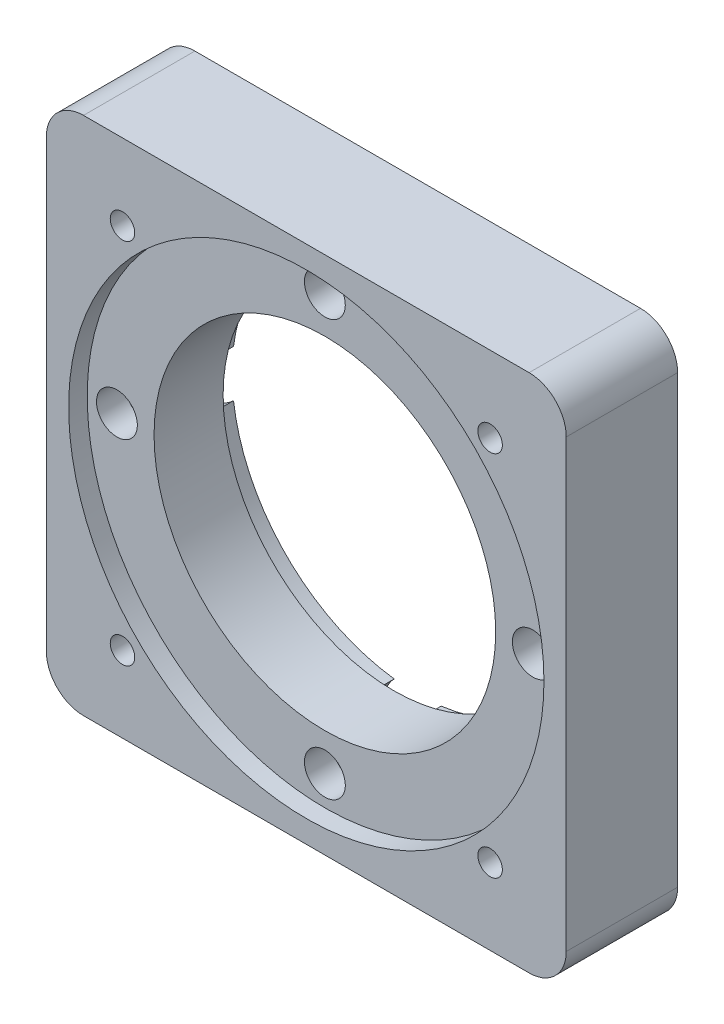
ISO-10303-21;
HEADER;
FILE_DESCRIPTION(('STEP AP214'),'2;1');
FILE_NAME('part.step','',(''),(''),'','','');
FILE_SCHEMA(('AUTOMOTIVE_DESIGN { 1 0 10303 214 1 1 1 1 }'));
ENDSEC;
DATA;
#1=APPLICATION_CONTEXT('core data for automotive mechanical design processes');
#2=APPLICATION_PROTOCOL_DEFINITION('international standard','automotive_design',2000,#1);
#3=PRODUCT_CONTEXT('',#1,'mechanical');
#4=PRODUCT('Part','Part','',(#3));
#5=PRODUCT_RELATED_PRODUCT_CATEGORY('part','',(#4));
#6=PRODUCT_DEFINITION_FORMATION('','',#4);
#7=PRODUCT_DEFINITION_CONTEXT('part definition',#1,'design');
#8=PRODUCT_DEFINITION('design','',#6,#7);
#9=PRODUCT_DEFINITION_SHAPE('','',#8);
#10=(LENGTH_UNIT() NAMED_UNIT(*) SI_UNIT(.MILLI.,.METRE.));
#11=(NAMED_UNIT(*) PLANE_ANGLE_UNIT() SI_UNIT($,.RADIAN.));
#12=(NAMED_UNIT(*) SI_UNIT($,.STERADIAN.) SOLID_ANGLE_UNIT());
#13=UNCERTAINTY_MEASURE_WITH_UNIT(LENGTH_MEASURE(1.E-05),#10,'distance_accuracy_value','');
#14=(GEOMETRIC_REPRESENTATION_CONTEXT(3) GLOBAL_UNCERTAINTY_ASSIGNED_CONTEXT((#13)) GLOBAL_UNIT_ASSIGNED_CONTEXT((#10,
#11,#12)) REPRESENTATION_CONTEXT('',''));
#15=CARTESIAN_POINT('',(0.,0.,0.));
#16=DIRECTION('',(0.,0.,1.));
#17=DIRECTION('',(1.,0.,0.));
#18=AXIS2_PLACEMENT_3D('',#15,#16,#17);
#19=CARTESIAN_POINT('',(0.,0.,-1.));
#20=DIRECTION('',(0.,0.,1.));
#21=DIRECTION('',(1.,0.,0.));
#22=AXIS2_PLACEMENT_3D('',#19,#20,#21);
#23=CYLINDRICAL_SURFACE('',#22,23.);
#24=CARTESIAN_POINT('',(0.,0.,12.5));
#25=DIRECTION('',(0.,0.,1.));
#26=DIRECTION('',(1.,0.,0.));
#27=AXIS2_PLACEMENT_3D('',#24,#25,#26);
#28=CIRCLE('',#27,23.);
#29=CARTESIAN_POINT('',(23.,0.,12.5));
#30=VERTEX_POINT('',#29);
#31=EDGE_CURVE('E298',#30,#30,#28,.T.);
#32=ORIENTED_EDGE('',*,*,#31,.T.);
#33=EDGE_LOOP('',(#32));
#34=FACE_BOUND('',#33,.T.);
#35=CARTESIAN_POINT('',(0.,0.,3.2));
#36=DIRECTION('',(0.,0.,-1.));
#37=DIRECTION('',(-1.,0.,0.));
#38=AXIS2_PLACEMENT_3D('',#35,#36,#37);
#39=CIRCLE('',#38,23.);
#40=CARTESIAN_POINT('',(-23.,0.,3.2));
#41=VERTEX_POINT('',#40);
#42=EDGE_CURVE('E200',#41,#41,#39,.F.);
#43=ORIENTED_EDGE('',*,*,#42,.F.);
#44=EDGE_LOOP('',(#43));
#45=FACE_BOUND('',#44,.T.);
#46=ADVANCED_FACE('F40',(#34,#45),#23,.F.);
#47=CARTESIAN_POINT('',(28.,2.93284432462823E-13,0.));
#48=DIRECTION('',(0.,0.,1.));
#49=DIRECTION('',(1.,0.,0.));
#50=AXIS2_PLACEMENT_3D('',#47,#48,#49);
#51=CYLINDRICAL_SURFACE('',#50,2.75);
#52=CARTESIAN_POINT('',(28.,2.93284432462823E-13,12.5));
#53=DIRECTION('',(0.,0.,1.));
#54=DIRECTION('',(0.,-1.,0.));
#55=AXIS2_PLACEMENT_3D('',#52,#53,#54);
#56=CIRCLE('',#55,2.75);
#57=CARTESIAN_POINT('',(28.,-2.74999999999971,12.5));
#58=VERTEX_POINT('',#57);
#59=EDGE_CURVE('E188',#58,#58,#56,.T.);
#60=ORIENTED_EDGE('',*,*,#59,.T.);
#61=EDGE_LOOP('',(#60));
#62=FACE_BOUND('',#61,.T.);
#63=CARTESIAN_POINT('',(28.,2.93284432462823E-13,8.65));
#64=DIRECTION('',(0.,0.,-1.));
#65=DIRECTION('',(-1.,0.,0.));
#66=AXIS2_PLACEMENT_3D('',#63,#64,#65);
#67=CIRCLE('',#66,2.75);
#68=CARTESIAN_POINT('',(25.25,2.93284432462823E-13,8.65));
#69=VERTEX_POINT('',#68);
#70=EDGE_CURVE('E195',#69,#69,#67,.F.);
#71=ORIENTED_EDGE('',*,*,#70,.F.);
#72=EDGE_LOOP('',(#71));
#73=FACE_BOUND('',#72,.T.);
#74=ADVANCED_FACE('F364',(#62,#73),#51,.F.);
#75=CARTESIAN_POINT('',(0.,-28.,0.));
#76=DIRECTION('',(0.,0.,1.));
#77=DIRECTION('',(1.,0.,0.));
#78=AXIS2_PLACEMENT_3D('',#75,#76,#77);
#79=CYLINDRICAL_SURFACE('',#78,2.75);
#80=CARTESIAN_POINT('',(0.,-28.,12.5));
#81=DIRECTION('',(0.,0.,1.));
#82=DIRECTION('',(-1.,0.,0.));
#83=AXIS2_PLACEMENT_3D('',#80,#81,#82);
#84=CIRCLE('',#83,2.75);
#85=CARTESIAN_POINT('',(-2.75,-28.,12.5));
#86=VERTEX_POINT('',#85);
#87=EDGE_CURVE('E313',#86,#86,#84,.T.);
#88=ORIENTED_EDGE('',*,*,#87,.T.);
#89=EDGE_LOOP('',(#88));
#90=FACE_BOUND('',#89,.T.);
#91=CARTESIAN_POINT('',(0.,-28.,8.65));
#92=DIRECTION('',(0.,0.,-1.));
#93=DIRECTION('',(-1.,0.,0.));
#94=AXIS2_PLACEMENT_3D('',#91,#92,#93);
#95=CIRCLE('',#94,2.75);
#96=CARTESIAN_POINT('',(-2.75,-28.,8.65));
#97=VERTEX_POINT('',#96);
#98=EDGE_CURVE('E190',#97,#97,#95,.F.);
#99=ORIENTED_EDGE('',*,*,#98,.F.);
#100=EDGE_LOOP('',(#99));
#101=FACE_BOUND('',#100,.T.);
#102=ADVANCED_FACE('F370',(#90,#101),#79,.F.);
#103=CARTESIAN_POINT('',(-28.,0.,0.));
#104=DIRECTION('',(0.,0.,1.));
#105=DIRECTION('',(1.,0.,0.));
#106=AXIS2_PLACEMENT_3D('',#103,#104,#105);
#107=CYLINDRICAL_SURFACE('',#106,2.75);
#108=CARTESIAN_POINT('',(-28.,0.,12.5));
#109=DIRECTION('',(0.,0.,1.));
#110=DIRECTION('',(0.,1.,0.));
#111=AXIS2_PLACEMENT_3D('',#108,#109,#110);
#112=CIRCLE('',#111,2.75);
#113=CARTESIAN_POINT('',(-28.,2.7499999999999,12.5));
#114=VERTEX_POINT('',#113);
#115=EDGE_CURVE('E316',#114,#114,#112,.T.);
#116=ORIENTED_EDGE('',*,*,#115,.T.);
#117=EDGE_LOOP('',(#116));
#118=FACE_BOUND('',#117,.T.);
#119=CARTESIAN_POINT('',(-28.,0.,8.65));
#120=DIRECTION('',(0.,0.,-1.));
#121=DIRECTION('',(-1.,0.,0.));
#122=AXIS2_PLACEMENT_3D('',#119,#120,#121);
#123=CIRCLE('',#122,2.75);
#124=CARTESIAN_POINT('',(-30.75,0.,8.65));
#125=VERTEX_POINT('',#124);
#126=EDGE_CURVE('E185',#125,#125,#123,.F.);
#127=ORIENTED_EDGE('',*,*,#126,.F.);
#128=EDGE_LOOP('',(#127));
#129=FACE_BOUND('',#128,.T.);
#130=ADVANCED_FACE('F404',(#118,#129),#107,.F.);
#131=CARTESIAN_POINT('',(0.,28.,0.));
#132=DIRECTION('',(0.,0.,1.));
#133=DIRECTION('',(1.,0.,0.));
#134=AXIS2_PLACEMENT_3D('',#131,#132,#133);
#135=CYLINDRICAL_SURFACE('',#134,2.75);
#136=CARTESIAN_POINT('',(0.,28.,12.5));
#137=DIRECTION('',(0.,0.,1.));
#138=DIRECTION('',(1.,0.,0.));
#139=AXIS2_PLACEMENT_3D('',#136,#137,#138);
#140=CIRCLE('',#139,2.75);
#141=CARTESIAN_POINT('',(2.75,28.,12.5));
#142=VERTEX_POINT('',#141);
#143=EDGE_CURVE('E183',#142,#142,#140,.T.);
#144=ORIENTED_EDGE('',*,*,#143,.T.);
#145=EDGE_LOOP('',(#144));
#146=FACE_BOUND('',#145,.T.);
#147=CARTESIAN_POINT('',(0.,28.,8.65));
#148=DIRECTION('',(0.,0.,-1.));
#149=DIRECTION('',(-1.,0.,0.));
#150=AXIS2_PLACEMENT_3D('',#147,#148,#149);
#151=CIRCLE('',#150,2.75);
#152=CARTESIAN_POINT('',(-2.75,28.,8.65));
#153=VERTEX_POINT('',#152);
#154=EDGE_CURVE('E180',#153,#153,#151,.F.);
#155=ORIENTED_EDGE('',*,*,#154,.F.);
#156=EDGE_LOOP('',(#155));
#157=FACE_BOUND('',#156,.T.);
#158=ADVANCED_FACE('F408',(#146,#157),#135,.F.);
#159=CARTESIAN_POINT('',(30.,-30.,15.));
#160=DIRECTION('',(0.,0.,-1.));
#161=DIRECTION('',(-1.,0.,0.));
#162=AXIS2_PLACEMENT_3D('',#159,#160,#161);
#163=CYLINDRICAL_SURFACE('',#162,5.);
#164=CARTESIAN_POINT('',(30.,-30.,0.));
#165=DIRECTION('',(0.,0.,1.));
#166=DIRECTION('',(-1.,0.,0.));
#167=AXIS2_PLACEMENT_3D('',#164,#165,#166);
#168=CIRCLE('',#167,5.);
#169=CARTESIAN_POINT('',(30.,-35.,0.));
#170=VERTEX_POINT('',#169);
#171=CARTESIAN_POINT('',(35.,-30.,0.));
#172=VERTEX_POINT('',#171);
#173=EDGE_CURVE('E149',#170,#172,#168,.T.);
#174=ORIENTED_EDGE('',*,*,#173,.T.);
#175=DIRECTION('',(0.,0.,-1.));
#176=VECTOR('',#175,1.);
#177=CARTESIAN_POINT('',(35.,-30.,15.));
#178=LINE('',#177,#176);
#179=CARTESIAN_POINT('',(35.,-30.,15.));
#180=VERTEX_POINT('',#179);
#181=EDGE_CURVE('E178',#180,#172,#178,.T.);
#182=ORIENTED_EDGE('',*,*,#181,.F.);
#183=CARTESIAN_POINT('',(30.,-30.,15.));
#184=DIRECTION('',(0.,0.,1.));
#185=DIRECTION('',(-1.,0.,0.));
#186=AXIS2_PLACEMENT_3D('',#183,#184,#185);
#187=CIRCLE('',#186,5.);
#188=CARTESIAN_POINT('',(30.,-35.,15.));
#189=VERTEX_POINT('',#188);
#190=EDGE_CURVE('E165',#189,#180,#187,.T.);
#191=ORIENTED_EDGE('',*,*,#190,.F.);
#192=DIRECTION('',(0.,0.,-1.));
#193=VECTOR('',#192,1.);
#194=CARTESIAN_POINT('',(30.,-35.,15.));
#195=LINE('',#194,#193);
#196=EDGE_CURVE('E145',#189,#170,#195,.T.);
#197=ORIENTED_EDGE('',*,*,#196,.T.);
#198=EDGE_LOOP('',(#174,#182,#191,#197));
#199=FACE_BOUND('',#198,.T.);
#200=ADVANCED_FACE('F42',(#199),#163,.T.);
#201=CARTESIAN_POINT('',(35.,-30.,15.));
#202=DIRECTION('',(-1.,0.,0.));
#203=DIRECTION('',(0.,0.,1.));
#204=AXIS2_PLACEMENT_3D('',#201,#202,#203);
#205=PLANE('',#204);
#206=DIRECTION('',(0.,1.,0.));
#207=VECTOR('',#206,1.);
#208=CARTESIAN_POINT('',(35.,-30.,0.));
#209=LINE('',#208,#207);
#210=CARTESIAN_POINT('',(35.,30.,0.));
#211=VERTEX_POINT('',#210);
#212=EDGE_CURVE('E152',#172,#211,#209,.T.);
#213=ORIENTED_EDGE('',*,*,#212,.T.);
#214=DIRECTION('',(0.,0.,-1.));
#215=VECTOR('',#214,1.);
#216=CARTESIAN_POINT('',(35.,30.,15.));
#217=LINE('',#216,#215);
#218=CARTESIAN_POINT('',(35.,30.,15.));
#219=VERTEX_POINT('',#218);
#220=EDGE_CURVE('E175',#219,#211,#217,.T.);
#221=ORIENTED_EDGE('',*,*,#220,.F.);
#222=DIRECTION('',(0.,1.,0.));
#223=VECTOR('',#222,1.);
#224=CARTESIAN_POINT('',(35.,-30.,15.));
#225=LINE('',#224,#223);
#226=EDGE_CURVE('E106',#180,#219,#225,.T.);
#227=ORIENTED_EDGE('',*,*,#226,.F.);
#228=ORIENTED_EDGE('',*,*,#181,.T.);
#229=EDGE_LOOP('',(#213,#221,#227,#228));
#230=FACE_BOUND('',#229,.T.);
#231=ADVANCED_FACE('F352',(#230),#205,.F.);
#232=CARTESIAN_POINT('',(30.,30.,15.));
#233=DIRECTION('',(0.,0.,-1.));
#234=DIRECTION('',(-1.,0.,0.));
#235=AXIS2_PLACEMENT_3D('',#232,#233,#234);
#236=CYLINDRICAL_SURFACE('',#235,5.);
#237=CARTESIAN_POINT('',(30.,30.,0.));
#238=DIRECTION('',(0.,0.,1.));
#239=DIRECTION('',(1.,0.,0.));
#240=AXIS2_PLACEMENT_3D('',#237,#238,#239);
#241=CIRCLE('',#240,5.);
#242=CARTESIAN_POINT('',(30.,35.,0.));
#243=VERTEX_POINT('',#242);
#244=EDGE_CURVE('E155',#211,#243,#241,.T.);
#245=ORIENTED_EDGE('',*,*,#244,.T.);
#246=DIRECTION('',(0.,0.,-1.));
#247=VECTOR('',#246,1.);
#248=CARTESIAN_POINT('',(30.,35.,15.));
#249=LINE('',#248,#247);
#250=CARTESIAN_POINT('',(30.,35.,15.));
#251=VERTEX_POINT('',#250);
#252=EDGE_CURVE('E172',#251,#243,#249,.T.);
#253=ORIENTED_EDGE('',*,*,#252,.F.);
#254=CARTESIAN_POINT('',(30.,30.,15.));
#255=DIRECTION('',(0.,0.,1.));
#256=DIRECTION('',(1.,0.,0.));
#257=AXIS2_PLACEMENT_3D('',#254,#255,#256);
#258=CIRCLE('',#257,5.);
#259=EDGE_CURVE('E333',#219,#251,#258,.T.);
#260=ORIENTED_EDGE('',*,*,#259,.F.);
#261=ORIENTED_EDGE('',*,*,#220,.T.);
#262=EDGE_LOOP('',(#245,#253,#260,#261));
#263=FACE_BOUND('',#262,.T.);
#264=ADVANCED_FACE('F355',(#263),#236,.T.);
#265=CARTESIAN_POINT('',(-30.,35.,15.));
#266=DIRECTION('',(0.,-1.,0.));
#267=DIRECTION('',(0.,0.,-1.));
#268=AXIS2_PLACEMENT_3D('',#265,#266,#267);
#269=PLANE('',#268);
#270=DIRECTION('',(-1.,0.,0.));
#271=VECTOR('',#270,1.);
#272=CARTESIAN_POINT('',(-30.,35.,0.));
#273=LINE('',#272,#271);
#274=CARTESIAN_POINT('',(-30.,35.,0.));
#275=VERTEX_POINT('',#274);
#276=EDGE_CURVE('E157',#243,#275,#273,.T.);
#277=ORIENTED_EDGE('',*,*,#276,.T.);
#278=DIRECTION('',(0.,0.,-1.));
#279=VECTOR('',#278,1.);
#280=CARTESIAN_POINT('',(-30.,35.,15.));
#281=LINE('',#280,#279);
#282=CARTESIAN_POINT('',(-30.,35.,15.));
#283=VERTEX_POINT('',#282);
#284=EDGE_CURVE('E169',#283,#275,#281,.T.);
#285=ORIENTED_EDGE('',*,*,#284,.F.);
#286=DIRECTION('',(-1.,0.,0.));
#287=VECTOR('',#286,1.);
#288=CARTESIAN_POINT('',(-30.,35.,15.));
#289=LINE('',#288,#287);
#290=EDGE_CURVE('E335',#251,#283,#289,.T.);
#291=ORIENTED_EDGE('',*,*,#290,.F.);
#292=ORIENTED_EDGE('',*,*,#252,.T.);
#293=EDGE_LOOP('',(#277,#285,#291,#292));
#294=FACE_BOUND('',#293,.T.);
#295=ADVANCED_FACE('F341',(#294),#269,.F.);
#296=CARTESIAN_POINT('',(-30.,30.,15.));
#297=DIRECTION('',(0.,0.,-1.));
#298=DIRECTION('',(-1.,0.,0.));
#299=AXIS2_PLACEMENT_3D('',#296,#297,#298);
#300=CYLINDRICAL_SURFACE('',#299,5.);
#301=CARTESIAN_POINT('',(-30.,30.,0.));
#302=DIRECTION('',(0.,0.,1.));
#303=DIRECTION('',(-1.,0.,0.));
#304=AXIS2_PLACEMENT_3D('',#301,#302,#303);
#305=CIRCLE('',#304,5.);
#306=CARTESIAN_POINT('',(-35.,30.,0.));
#307=VERTEX_POINT('',#306);
#308=EDGE_CURVE('E159',#275,#307,#305,.T.);
#309=ORIENTED_EDGE('',*,*,#308,.T.);
#310=DIRECTION('',(0.,0.,-1.));
#311=VECTOR('',#310,1.);
#312=CARTESIAN_POINT('',(-35.,30.,15.));
#313=LINE('',#312,#311);
#314=CARTESIAN_POINT('',(-35.,30.,15.));
#315=VERTEX_POINT('',#314);
#316=EDGE_CURVE('E140',#315,#307,#313,.T.);
#317=ORIENTED_EDGE('',*,*,#316,.F.);
#318=CARTESIAN_POINT('',(-30.,30.,15.));
#319=DIRECTION('',(0.,0.,1.));
#320=DIRECTION('',(-1.,0.,0.));
#321=AXIS2_PLACEMENT_3D('',#318,#319,#320);
#322=CIRCLE('',#321,5.);
#323=EDGE_CURVE('E128',#283,#315,#322,.T.);
#324=ORIENTED_EDGE('',*,*,#323,.F.);
#325=ORIENTED_EDGE('',*,*,#284,.T.);
#326=EDGE_LOOP('',(#309,#317,#324,#325));
#327=FACE_BOUND('',#326,.T.);
#328=ADVANCED_FACE('F345',(#327),#300,.T.);
#329=CARTESIAN_POINT('',(-35.,-30.,15.));
#330=DIRECTION('',(1.,0.,0.));
#331=DIRECTION('',(0.,0.,-1.));
#332=AXIS2_PLACEMENT_3D('',#329,#330,#331);
#333=PLANE('',#332);
#334=DIRECTION('',(0.,-1.,0.));
#335=VECTOR('',#334,1.);
#336=CARTESIAN_POINT('',(-35.,-30.,0.));
#337=LINE('',#336,#335);
#338=CARTESIAN_POINT('',(-35.,-30.,0.));
#339=VERTEX_POINT('',#338);
#340=EDGE_CURVE('E137',#307,#339,#337,.T.);
#341=ORIENTED_EDGE('',*,*,#340,.T.);
#342=DIRECTION('',(0.,0.,-1.));
#343=VECTOR('',#342,1.);
#344=CARTESIAN_POINT('',(-35.,-30.,15.));
#345=LINE('',#344,#343);
#346=CARTESIAN_POINT('',(-35.,-30.,15.));
#347=VERTEX_POINT('',#346);
#348=EDGE_CURVE('E134',#347,#339,#345,.T.);
#349=ORIENTED_EDGE('',*,*,#348,.F.);
#350=DIRECTION('',(0.,-1.,0.));
#351=VECTOR('',#350,1.);
#352=CARTESIAN_POINT('',(-35.,-30.,15.));
#353=LINE('',#352,#351);
#354=EDGE_CURVE('E121',#315,#347,#353,.T.);
#355=ORIENTED_EDGE('',*,*,#354,.F.);
#356=ORIENTED_EDGE('',*,*,#316,.T.);
#357=EDGE_LOOP('',(#341,#349,#355,#356));
#358=FACE_BOUND('',#357,.T.);
#359=ADVANCED_FACE('F135',(#358),#333,.F.);
#360=CARTESIAN_POINT('',(-30.,-30.,15.));
#361=DIRECTION('',(0.,0.,-1.));
#362=DIRECTION('',(-1.,0.,0.));
#363=AXIS2_PLACEMENT_3D('',#360,#361,#362);
#364=CYLINDRICAL_SURFACE('',#363,5.);
#365=CARTESIAN_POINT('',(-30.,-30.,0.));
#366=DIRECTION('',(0.,0.,1.));
#367=DIRECTION('',(-1.,0.,0.));
#368=AXIS2_PLACEMENT_3D('',#365,#366,#367);
#369=CIRCLE('',#368,5.);
#370=CARTESIAN_POINT('',(-30.,-35.,0.));
#371=VERTEX_POINT('',#370);
#372=EDGE_CURVE('E162',#339,#371,#369,.T.);
#373=ORIENTED_EDGE('',*,*,#372,.T.);
#374=DIRECTION('',(0.,0.,-1.));
#375=VECTOR('',#374,1.);
#376=CARTESIAN_POINT('',(-30.,-35.,15.));
#377=LINE('',#376,#375);
#378=CARTESIAN_POINT('',(-30.,-35.,15.));
#379=VERTEX_POINT('',#378);
#380=EDGE_CURVE('E141',#379,#371,#377,.T.);
#381=ORIENTED_EDGE('',*,*,#380,.F.);
#382=CARTESIAN_POINT('',(-30.,-30.,15.));
#383=DIRECTION('',(0.,0.,1.));
#384=DIRECTION('',(-1.,0.,0.));
#385=AXIS2_PLACEMENT_3D('',#382,#383,#384);
#386=CIRCLE('',#385,5.);
#387=EDGE_CURVE('E125',#347,#379,#386,.T.);
#388=ORIENTED_EDGE('',*,*,#387,.F.);
#389=ORIENTED_EDGE('',*,*,#348,.T.);
#390=EDGE_LOOP('',(#373,#381,#388,#389));
#391=FACE_BOUND('',#390,.T.);
#392=ADVANCED_FACE('F143',(#391),#364,.T.);
#393=CARTESIAN_POINT('',(-30.,-35.,15.));
#394=DIRECTION('',(0.,1.,0.));
#395=DIRECTION('',(0.,0.,1.));
#396=AXIS2_PLACEMENT_3D('',#393,#394,#395);
#397=PLANE('',#396);
#398=DIRECTION('',(1.,0.,0.));
#399=VECTOR('',#398,1.);
#400=CARTESIAN_POINT('',(-30.,-35.,0.));
#401=LINE('',#400,#399);
#402=EDGE_CURVE('E97',#371,#170,#401,.T.);
#403=ORIENTED_EDGE('',*,*,#402,.T.);
#404=ORIENTED_EDGE('',*,*,#196,.F.);
#405=DIRECTION('',(1.,0.,0.));
#406=VECTOR('',#405,1.);
#407=CARTESIAN_POINT('',(-30.,-35.,15.));
#408=LINE('',#407,#406);
#409=EDGE_CURVE('E64',#379,#189,#408,.T.);
#410=ORIENTED_EDGE('',*,*,#409,.F.);
#411=ORIENTED_EDGE('',*,*,#380,.T.);
#412=EDGE_LOOP('',(#403,#404,#410,#411));
#413=FACE_BOUND('',#412,.T.);
#414=ADVANCED_FACE('F348',(#413),#397,.F.);
#415=CARTESIAN_POINT('',(30.,-30.,15.));
#416=DIRECTION('',(0.,0.,-1.));
#417=DIRECTION('',(-1.,0.,0.));
#418=AXIS2_PLACEMENT_3D('',#415,#416,#417);
#419=PLANE('',#418);
#420=CARTESIAN_POINT('',(24.75,24.75,15.));
#421=DIRECTION('',(0.,0.,-1.));
#422=DIRECTION('',(-1.,0.,0.));
#423=AXIS2_PLACEMENT_3D('',#420,#421,#422);
#424=CIRCLE('',#423,1.64999999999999);
#425=CARTESIAN_POINT('',(23.1,24.75,15.));
#426=VERTEX_POINT('',#425);
#427=EDGE_CURVE('E277',#426,#426,#424,.T.);
#428=ORIENTED_EDGE('',*,*,#427,.T.);
#429=EDGE_LOOP('',(#428));
#430=FACE_BOUND('',#429,.T.);
#431=CARTESIAN_POINT('',(-24.75,24.75,15.));
#432=DIRECTION('',(0.,0.,-1.));
#433=DIRECTION('',(-1.,0.,0.));
#434=AXIS2_PLACEMENT_3D('',#431,#432,#433);
#435=CIRCLE('',#434,1.64999999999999);
#436=CARTESIAN_POINT('',(-26.4,24.75,15.));
#437=VERTEX_POINT('',#436);
#438=EDGE_CURVE('E283',#437,#437,#435,.T.);
#439=ORIENTED_EDGE('',*,*,#438,.T.);
#440=EDGE_LOOP('',(#439));
#441=FACE_BOUND('',#440,.T.);
#442=CARTESIAN_POINT('',(-24.75,-24.75,15.));
#443=DIRECTION('',(0.,0.,-1.));
#444=DIRECTION('',(-1.,0.,0.));
#445=AXIS2_PLACEMENT_3D('',#442,#443,#444);
#446=CIRCLE('',#445,1.64999999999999);
#447=CARTESIAN_POINT('',(-26.4,-24.75,15.));
#448=VERTEX_POINT('',#447);
#449=EDGE_CURVE('E289',#448,#448,#446,.T.);
#450=ORIENTED_EDGE('',*,*,#449,.T.);
#451=EDGE_LOOP('',(#450));
#452=FACE_BOUND('',#451,.T.);
#453=CARTESIAN_POINT('',(24.75,-24.75,15.));
#454=DIRECTION('',(0.,0.,-1.));
#455=DIRECTION('',(-1.,0.,0.));
#456=AXIS2_PLACEMENT_3D('',#453,#454,#455);
#457=CIRCLE('',#456,1.64999999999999);
#458=CARTESIAN_POINT('',(23.1,-24.75,15.));
#459=VERTEX_POINT('',#458);
#460=EDGE_CURVE('E295',#459,#459,#457,.T.);
#461=ORIENTED_EDGE('',*,*,#460,.T.);
#462=EDGE_LOOP('',(#461));
#463=FACE_BOUND('',#462,.T.);
#464=CARTESIAN_POINT('',(0.,0.,15.));
#465=DIRECTION('',(0.,0.,1.));
#466=DIRECTION('',(1.,0.,0.));
#467=AXIS2_PLACEMENT_3D('',#464,#465,#466);
#468=CIRCLE('',#467,32.);
#469=CARTESIAN_POINT('',(32.,0.,15.));
#470=VERTEX_POINT('',#469);
#471=EDGE_CURVE('E326',#470,#470,#468,.T.);
#472=ORIENTED_EDGE('',*,*,#471,.F.);
#473=EDGE_LOOP('',(#472));
#474=FACE_BOUND('',#473,.T.);
#475=ORIENTED_EDGE('',*,*,#190,.T.);
#476=ORIENTED_EDGE('',*,*,#226,.T.);
#477=ORIENTED_EDGE('',*,*,#259,.T.);
#478=ORIENTED_EDGE('',*,*,#290,.T.);
#479=ORIENTED_EDGE('',*,*,#323,.T.);
#480=ORIENTED_EDGE('',*,*,#354,.T.);
#481=ORIENTED_EDGE('',*,*,#387,.T.);
#482=ORIENTED_EDGE('',*,*,#409,.T.);
#483=EDGE_LOOP('',(#475,#476,#477,#478,#479,#480,#481,#482));
#484=FACE_BOUND('',#483,.T.);
#485=ADVANCED_FACE('F123',(#430,#441,#452,#463,#474,#484),#419,.F.);
#486=CARTESIAN_POINT('',(30.,-30.,0.));
#487=DIRECTION('',(0.,0.,-1.));
#488=DIRECTION('',(-1.,0.,0.));
#489=AXIS2_PLACEMENT_3D('',#486,#487,#488);
#490=PLANE('',#489);
#491=CARTESIAN_POINT('',(0.,0.,0.));
#492=DIRECTION('',(0.,0.,-1.));
#493=DIRECTION('',(-1.,0.,0.));
#494=AXIS2_PLACEMENT_3D('',#491,#492,#493);
#495=CIRCLE('',#494,25.);
#496=CARTESIAN_POINT('',(-24.7991071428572,3.16295509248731,0.));
#497=VERTEX_POINT('',#496);
#498=CARTESIAN_POINT('',(-3.1629550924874,24.7991071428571,0.));
#499=VERTEX_POINT('',#498);
#500=EDGE_CURVE('E242',#497,#499,#495,.T.);
#501=ORIENTED_EDGE('',*,*,#500,.F.);
#502=CARTESIAN_POINT('',(-28.,0.,0.));
#503=DIRECTION('',(0.,0.,-1.));
#504=DIRECTION('',(0.,-1.,0.));
#505=AXIS2_PLACEMENT_3D('',#502,#503,#504);
#506=CIRCLE('',#505,4.5);
#507=CARTESIAN_POINT('',(-24.7991071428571,-3.16295509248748,0.));
#508=VERTEX_POINT('',#507);
#509=EDGE_CURVE('E193',#508,#497,#506,.T.);
#510=ORIENTED_EDGE('',*,*,#509,.F.);
#511=CARTESIAN_POINT('',(-3.1629550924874,-24.7991071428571,0.));
#512=VERTEX_POINT('',#511);
#513=EDGE_CURVE('E239',#512,#508,#495,.T.);
#514=ORIENTED_EDGE('',*,*,#513,.F.);
#515=CARTESIAN_POINT('',(0.,-28.,0.));
#516=DIRECTION('',(0.,0.,-1.));
#517=DIRECTION('',(1.,0.,0.));
#518=AXIS2_PLACEMENT_3D('',#515,#516,#517);
#519=CIRCLE('',#518,4.5);
#520=CARTESIAN_POINT('',(3.1629550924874,-24.7991071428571,0.));
#521=VERTEX_POINT('',#520);
#522=EDGE_CURVE('E198',#521,#512,#519,.T.);
#523=ORIENTED_EDGE('',*,*,#522,.F.);
#524=CARTESIAN_POINT('',(24.7991071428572,-3.16295509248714,0.));
#525=VERTEX_POINT('',#524);
#526=EDGE_CURVE('E224',#525,#521,#495,.T.);
#527=ORIENTED_EDGE('',*,*,#526,.F.);
#528=CARTESIAN_POINT('',(28.,2.93284432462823E-13,0.));
#529=DIRECTION('',(0.,0.,-1.));
#530=DIRECTION('',(0.,1.,0.));
#531=AXIS2_PLACEMENT_3D('',#528,#529,#530);
#532=CIRCLE('',#531,4.5);
#533=CARTESIAN_POINT('',(24.7991071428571,3.16295509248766,0.));
#534=VERTEX_POINT('',#533);
#535=EDGE_CURVE('E213',#534,#525,#532,.T.);
#536=ORIENTED_EDGE('',*,*,#535,.F.);
#537=CARTESIAN_POINT('',(3.1629550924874,24.7991071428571,0.));
#538=VERTEX_POINT('',#537);
#539=EDGE_CURVE('E238',#538,#534,#495,.T.);
#540=ORIENTED_EDGE('',*,*,#539,.F.);
#541=CARTESIAN_POINT('',(0.,28.,0.));
#542=DIRECTION('',(0.,0.,-1.));
#543=DIRECTION('',(-1.,0.,0.));
#544=AXIS2_PLACEMENT_3D('',#541,#542,#543);
#545=CIRCLE('',#544,4.5);
#546=EDGE_CURVE('E319',#499,#538,#545,.T.);
#547=ORIENTED_EDGE('',*,*,#546,.F.);
#548=EDGE_LOOP('',(#501,#510,#514,#523,#527,#536,#540,#547));
#549=FACE_BOUND('',#548,.T.);
#550=CARTESIAN_POINT('',(24.75,24.75,0.));
#551=DIRECTION('',(0.,0.,-1.));
#552=DIRECTION('',(-1.,0.,0.));
#553=AXIS2_PLACEMENT_3D('',#550,#551,#552);
#554=CIRCLE('',#553,1.64999999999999);
#555=CARTESIAN_POINT('',(23.1,24.75,0.));
#556=VERTEX_POINT('',#555);
#557=EDGE_CURVE('E274',#556,#556,#554,.T.);
#558=ORIENTED_EDGE('',*,*,#557,.F.);
#559=EDGE_LOOP('',(#558));
#560=FACE_BOUND('',#559,.T.);
#561=CARTESIAN_POINT('',(-24.75,24.75,0.));
#562=DIRECTION('',(0.,0.,-1.));
#563=DIRECTION('',(-1.,0.,0.));
#564=AXIS2_PLACEMENT_3D('',#561,#562,#563);
#565=CIRCLE('',#564,1.64999999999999);
#566=CARTESIAN_POINT('',(-26.4,24.75,0.));
#567=VERTEX_POINT('',#566);
#568=EDGE_CURVE('E280',#567,#567,#565,.T.);
#569=ORIENTED_EDGE('',*,*,#568,.F.);
#570=EDGE_LOOP('',(#569));
#571=FACE_BOUND('',#570,.T.);
#572=CARTESIAN_POINT('',(-24.75,-24.75,0.));
#573=DIRECTION('',(0.,0.,-1.));
#574=DIRECTION('',(-1.,0.,0.));
#575=AXIS2_PLACEMENT_3D('',#572,#573,#574);
#576=CIRCLE('',#575,1.64999999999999);
#577=CARTESIAN_POINT('',(-26.4,-24.75,0.));
#578=VERTEX_POINT('',#577);
#579=EDGE_CURVE('E286',#578,#578,#576,.T.);
#580=ORIENTED_EDGE('',*,*,#579,.F.);
#581=EDGE_LOOP('',(#580));
#582=FACE_BOUND('',#581,.T.);
#583=CARTESIAN_POINT('',(24.75,-24.75,0.));
#584=DIRECTION('',(0.,0.,-1.));
#585=DIRECTION('',(-1.,0.,0.));
#586=AXIS2_PLACEMENT_3D('',#583,#584,#585);
#587=CIRCLE('',#586,1.64999999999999);
#588=CARTESIAN_POINT('',(23.1,-24.75,0.));
#589=VERTEX_POINT('',#588);
#590=EDGE_CURVE('E292',#589,#589,#587,.T.);
#591=ORIENTED_EDGE('',*,*,#590,.F.);
#592=EDGE_LOOP('',(#591));
#593=FACE_BOUND('',#592,.T.);
#594=ORIENTED_EDGE('',*,*,#173,.F.);
#595=ORIENTED_EDGE('',*,*,#402,.F.);
#596=ORIENTED_EDGE('',*,*,#372,.F.);
#597=ORIENTED_EDGE('',*,*,#340,.F.);
#598=ORIENTED_EDGE('',*,*,#308,.F.);
#599=ORIENTED_EDGE('',*,*,#276,.F.);
#600=ORIENTED_EDGE('',*,*,#244,.F.);
#601=ORIENTED_EDGE('',*,*,#212,.F.);
#602=EDGE_LOOP('',(#594,#595,#596,#597,#598,#599,#600,#601));
#603=FACE_BOUND('',#602,.T.);
#604=ADVANCED_FACE('F233',(#549,#560,#571,#582,#593,#603),#490,.T.);
#605=CARTESIAN_POINT('',(0.,0.,12.5));
#606=DIRECTION('',(0.,0.,1.));
#607=DIRECTION('',(1.,0.,0.));
#608=AXIS2_PLACEMENT_3D('',#605,#606,#607);
#609=CYLINDRICAL_SURFACE('',#608,32.);
#610=CARTESIAN_POINT('',(0.,0.,12.5));
#611=DIRECTION('',(0.,0.,1.));
#612=DIRECTION('',(1.,0.,0.));
#613=AXIS2_PLACEMENT_3D('',#610,#611,#612);
#614=CIRCLE('',#613,32.);
#615=CARTESIAN_POINT('',(32.,0.,12.5));
#616=VERTEX_POINT('',#615);
#617=EDGE_CURVE('E153',#616,#616,#614,.T.);
#618=ORIENTED_EDGE('',*,*,#617,.F.);
#619=EDGE_LOOP('',(#618));
#620=FACE_BOUND('',#619,.T.);
#621=ORIENTED_EDGE('',*,*,#471,.T.);
#622=EDGE_LOOP('',(#621));
#623=FACE_BOUND('',#622,.T.);
#624=ADVANCED_FACE('F423',(#620,#623),#609,.F.);
#625=CARTESIAN_POINT('',(0.,0.,12.5));
#626=DIRECTION('',(0.,0.,1.));
#627=DIRECTION('',(1.,0.,0.));
#628=AXIS2_PLACEMENT_3D('',#625,#626,#627);
#629=PLANE('',#628);
#630=ORIENTED_EDGE('',*,*,#31,.F.);
#631=EDGE_LOOP('',(#630));
#632=FACE_BOUND('',#631,.T.);
#633=ORIENTED_EDGE('',*,*,#59,.F.);
#634=EDGE_LOOP('',(#633));
#635=FACE_BOUND('',#634,.T.);
#636=ORIENTED_EDGE('',*,*,#87,.F.);
#637=EDGE_LOOP('',(#636));
#638=FACE_BOUND('',#637,.T.);
#639=ORIENTED_EDGE('',*,*,#115,.F.);
#640=EDGE_LOOP('',(#639));
#641=FACE_BOUND('',#640,.T.);
#642=ORIENTED_EDGE('',*,*,#143,.F.);
#643=EDGE_LOOP('',(#642));
#644=FACE_BOUND('',#643,.T.);
#645=ORIENTED_EDGE('',*,*,#617,.T.);
#646=EDGE_LOOP('',(#645));
#647=FACE_BOUND('',#646,.T.);
#648=ADVANCED_FACE('F413',(#632,#635,#638,#641,#644,#647),#629,.T.);
#649=CARTESIAN_POINT('',(0.,28.,8.65));
#650=DIRECTION('',(0.,0.,-1.));
#651=DIRECTION('',(-1.,0.,0.));
#652=AXIS2_PLACEMENT_3D('',#649,#650,#651);
#653=PLANE('',#652);
#654=CARTESIAN_POINT('',(0.,28.,8.65));
#655=DIRECTION('',(0.,0.,-1.));
#656=DIRECTION('',(-1.,0.,0.));
#657=AXIS2_PLACEMENT_3D('',#654,#655,#656);
#658=CIRCLE('',#657,4.5);
#659=CARTESIAN_POINT('',(-4.5,28.,8.65));
#660=VERTEX_POINT('',#659);
#661=EDGE_CURVE('E184',#660,#660,#658,.T.);
#662=ORIENTED_EDGE('',*,*,#661,.T.);
#663=EDGE_LOOP('',(#662));
#664=FACE_BOUND('',#663,.T.);
#665=ORIENTED_EDGE('',*,*,#154,.T.);
#666=EDGE_LOOP('',(#665));
#667=FACE_BOUND('',#666,.T.);
#668=ADVANCED_FACE('F410',(#664,#667),#653,.T.);
#669=CARTESIAN_POINT('',(0.,28.,8.65));
#670=DIRECTION('',(0.,0.,-1.));
#671=DIRECTION('',(-1.,0.,0.));
#672=AXIS2_PLACEMENT_3D('',#669,#670,#671);
#673=CYLINDRICAL_SURFACE('',#672,4.5);
#674=ORIENTED_EDGE('',*,*,#661,.F.);
#675=EDGE_LOOP('',(#674));
#676=FACE_BOUND('',#675,.T.);
#677=CARTESIAN_POINT('',(0.,28.,3.2));
#678=DIRECTION('',(0.,0.,-1.));
#679=DIRECTION('',(-1.,0.,0.));
#680=AXIS2_PLACEMENT_3D('',#677,#678,#679);
#681=CIRCLE('',#680,4.5);
#682=CARTESIAN_POINT('',(-3.1629550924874,24.7991071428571,3.2));
#683=VERTEX_POINT('',#682);
#684=CARTESIAN_POINT('',(3.1629550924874,24.7991071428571,3.2));
#685=VERTEX_POINT('',#684);
#686=EDGE_CURVE('E255',#683,#685,#681,.F.);
#687=ORIENTED_EDGE('',*,*,#686,.F.);
#688=DIRECTION('',(0.,0.,-1.));
#689=VECTOR('',#688,1.);
#690=CARTESIAN_POINT('',(-3.16295509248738,24.7991071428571,1.6));
#691=LINE('',#690,#689);
#692=EDGE_CURVE('E271',#683,#499,#691,.T.);
#693=ORIENTED_EDGE('',*,*,#692,.T.);
#694=ORIENTED_EDGE('',*,*,#546,.T.);
#695=DIRECTION('',(0.,0.,-1.));
#696=VECTOR('',#695,1.);
#697=CARTESIAN_POINT('',(3.16295509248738,24.7991071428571,1.6));
#698=LINE('',#697,#696);
#699=EDGE_CURVE('E268',#538,#685,#698,.F.);
#700=ORIENTED_EDGE('',*,*,#699,.T.);
#701=EDGE_LOOP('',(#687,#693,#694,#700));
#702=FACE_BOUND('',#701,.T.);
#703=ADVANCED_FACE('F397',(#676,#702),#673,.F.);
#704=CARTESIAN_POINT('',(-28.,0.,8.65));
#705=DIRECTION('',(0.,0.,-1.));
#706=DIRECTION('',(0.,-1.,0.));
#707=AXIS2_PLACEMENT_3D('',#704,#705,#706);
#708=PLANE('',#707);
#709=CARTESIAN_POINT('',(-28.,0.,8.65));
#710=DIRECTION('',(0.,0.,-1.));
#711=DIRECTION('',(0.,-1.,0.));
#712=AXIS2_PLACEMENT_3D('',#709,#710,#711);
#713=CIRCLE('',#712,4.5);
#714=CARTESIAN_POINT('',(-28.,-4.5000000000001,8.65));
#715=VERTEX_POINT('',#714);
#716=EDGE_CURVE('E189',#715,#715,#713,.T.);
#717=ORIENTED_EDGE('',*,*,#716,.T.);
#718=EDGE_LOOP('',(#717));
#719=FACE_BOUND('',#718,.T.);
#720=ORIENTED_EDGE('',*,*,#126,.T.);
#721=EDGE_LOOP('',(#720));
#722=FACE_BOUND('',#721,.T.);
#723=ADVANCED_FACE('F394',(#719,#722),#708,.T.);
#724=CARTESIAN_POINT('',(-28.,0.,8.65));
#725=DIRECTION('',(0.,0.,-1.));
#726=DIRECTION('',(-1.,0.,0.));
#727=AXIS2_PLACEMENT_3D('',#724,#725,#726);
#728=CYLINDRICAL_SURFACE('',#727,4.5);
#729=ORIENTED_EDGE('',*,*,#716,.F.);
#730=EDGE_LOOP('',(#729));
#731=FACE_BOUND('',#730,.T.);
#732=CARTESIAN_POINT('',(-28.,0.,3.2));
#733=DIRECTION('',(0.,0.,-1.));
#734=DIRECTION('',(-1.,0.,0.));
#735=AXIS2_PLACEMENT_3D('',#732,#733,#734);
#736=CIRCLE('',#735,4.5);
#737=CARTESIAN_POINT('',(-24.7991071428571,-3.16295509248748,3.2));
#738=VERTEX_POINT('',#737);
#739=CARTESIAN_POINT('',(-24.7991071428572,3.16295509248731,3.2));
#740=VERTEX_POINT('',#739);
#741=EDGE_CURVE('E252',#738,#740,#736,.F.);
#742=ORIENTED_EDGE('',*,*,#741,.F.);
#743=DIRECTION('',(0.,0.,-1.));
#744=VECTOR('',#743,1.);
#745=CARTESIAN_POINT('',(-24.7991071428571,-3.16295509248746,1.6));
#746=LINE('',#745,#744);
#747=EDGE_CURVE('E265',#738,#508,#746,.T.);
#748=ORIENTED_EDGE('',*,*,#747,.T.);
#749=ORIENTED_EDGE('',*,*,#509,.T.);
#750=DIRECTION('',(0.,0.,-1.));
#751=VECTOR('',#750,1.);
#752=CARTESIAN_POINT('',(-24.7991071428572,3.16295509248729,1.6));
#753=LINE('',#752,#751);
#754=EDGE_CURVE('E262',#497,#740,#753,.F.);
#755=ORIENTED_EDGE('',*,*,#754,.T.);
#756=EDGE_LOOP('',(#742,#748,#749,#755));
#757=FACE_BOUND('',#756,.T.);
#758=ADVANCED_FACE('F389',(#731,#757),#728,.F.);
#759=CARTESIAN_POINT('',(0.,-28.,8.65));
#760=DIRECTION('',(0.,0.,-1.));
#761=DIRECTION('',(1.,0.,0.));
#762=AXIS2_PLACEMENT_3D('',#759,#760,#761);
#763=PLANE('',#762);
#764=CARTESIAN_POINT('',(0.,-28.,8.65));
#765=DIRECTION('',(0.,0.,-1.));
#766=DIRECTION('',(1.,0.,0.));
#767=AXIS2_PLACEMENT_3D('',#764,#765,#766);
#768=CIRCLE('',#767,4.5);
#769=CARTESIAN_POINT('',(4.5,-28.,8.65));
#770=VERTEX_POINT('',#769);
#771=EDGE_CURVE('E194',#770,#770,#768,.T.);
#772=ORIENTED_EDGE('',*,*,#771,.T.);
#773=EDGE_LOOP('',(#772));
#774=FACE_BOUND('',#773,.T.);
#775=ORIENTED_EDGE('',*,*,#98,.T.);
#776=EDGE_LOOP('',(#775));
#777=FACE_BOUND('',#776,.T.);
#778=ADVANCED_FACE('F386',(#774,#777),#763,.T.);
#779=CARTESIAN_POINT('',(0.,-28.,8.65));
#780=DIRECTION('',(0.,0.,-1.));
#781=DIRECTION('',(-1.,0.,0.));
#782=AXIS2_PLACEMENT_3D('',#779,#780,#781);
#783=CYLINDRICAL_SURFACE('',#782,4.5);
#784=ORIENTED_EDGE('',*,*,#771,.F.);
#785=EDGE_LOOP('',(#784));
#786=FACE_BOUND('',#785,.T.);
#787=CARTESIAN_POINT('',(0.,-28.,3.2));
#788=DIRECTION('',(0.,0.,-1.));
#789=DIRECTION('',(-1.,0.,0.));
#790=AXIS2_PLACEMENT_3D('',#787,#788,#789);
#791=CIRCLE('',#790,4.5);
#792=CARTESIAN_POINT('',(3.1629550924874,-24.7991071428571,3.2));
#793=VERTEX_POINT('',#792);
#794=CARTESIAN_POINT('',(-3.1629550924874,-24.7991071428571,3.2));
#795=VERTEX_POINT('',#794);
#796=EDGE_CURVE('E249',#793,#795,#791,.F.);
#797=ORIENTED_EDGE('',*,*,#796,.F.);
#798=DIRECTION('',(0.,0.,-1.));
#799=VECTOR('',#798,1.);
#800=CARTESIAN_POINT('',(3.16295509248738,-24.7991071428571,1.6));
#801=LINE('',#800,#799);
#802=EDGE_CURVE('E260',#793,#521,#801,.T.);
#803=ORIENTED_EDGE('',*,*,#802,.T.);
#804=ORIENTED_EDGE('',*,*,#522,.T.);
#805=DIRECTION('',(0.,0.,-1.));
#806=VECTOR('',#805,1.);
#807=CARTESIAN_POINT('',(-3.16295509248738,-24.7991071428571,1.6));
#808=LINE('',#807,#806);
#809=EDGE_CURVE('E257',#512,#795,#808,.F.);
#810=ORIENTED_EDGE('',*,*,#809,.T.);
#811=EDGE_LOOP('',(#797,#803,#804,#810));
#812=FACE_BOUND('',#811,.T.);
#813=ADVANCED_FACE('F381',(#786,#812),#783,.F.);
#814=CARTESIAN_POINT('',(28.,2.93284432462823E-13,8.65));
#815=DIRECTION('',(0.,0.,-1.));
#816=DIRECTION('',(0.,1.,0.));
#817=AXIS2_PLACEMENT_3D('',#814,#815,#816);
#818=PLANE('',#817);
#819=CARTESIAN_POINT('',(28.,2.93284432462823E-13,8.65));
#820=DIRECTION('',(0.,0.,-1.));
#821=DIRECTION('',(0.,1.,0.));
#822=AXIS2_PLACEMENT_3D('',#819,#820,#821);
#823=CIRCLE('',#822,4.5);
#824=CARTESIAN_POINT('',(28.,4.50000000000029,8.65));
#825=VERTEX_POINT('',#824);
#826=EDGE_CURVE('E199',#825,#825,#823,.T.);
#827=ORIENTED_EDGE('',*,*,#826,.T.);
#828=EDGE_LOOP('',(#827));
#829=FACE_BOUND('',#828,.T.);
#830=ORIENTED_EDGE('',*,*,#70,.T.);
#831=EDGE_LOOP('',(#830));
#832=FACE_BOUND('',#831,.T.);
#833=ADVANCED_FACE('F378',(#829,#832),#818,.T.);
#834=CARTESIAN_POINT('',(28.,2.93284432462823E-13,8.65));
#835=DIRECTION('',(0.,0.,-1.));
#836=DIRECTION('',(-1.,0.,0.));
#837=AXIS2_PLACEMENT_3D('',#834,#835,#836);
#838=CYLINDRICAL_SURFACE('',#837,4.5);
#839=ORIENTED_EDGE('',*,*,#826,.F.);
#840=EDGE_LOOP('',(#839));
#841=FACE_BOUND('',#840,.T.);
#842=CARTESIAN_POINT('',(28.,2.93284432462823E-13,3.2));
#843=DIRECTION('',(0.,0.,-1.));
#844=DIRECTION('',(-1.,0.,0.));
#845=AXIS2_PLACEMENT_3D('',#842,#843,#844);
#846=CIRCLE('',#845,4.5);
#847=CARTESIAN_POINT('',(24.7991071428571,3.16295509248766,3.2));
#848=VERTEX_POINT('',#847);
#849=CARTESIAN_POINT('',(24.7991071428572,-3.16295509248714,3.2));
#850=VERTEX_POINT('',#849);
#851=EDGE_CURVE('E202',#848,#850,#846,.F.);
#852=ORIENTED_EDGE('',*,*,#851,.F.);
#853=DIRECTION('',(0.,0.,-1.));
#854=VECTOR('',#853,1.);
#855=CARTESIAN_POINT('',(24.7991071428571,3.16295509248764,1.6));
#856=LINE('',#855,#854);
#857=EDGE_CURVE('E11',#848,#534,#856,.T.);
#858=ORIENTED_EDGE('',*,*,#857,.T.);
#859=ORIENTED_EDGE('',*,*,#535,.T.);
#860=DIRECTION('',(0.,0.,-1.));
#861=VECTOR('',#860,1.);
#862=CARTESIAN_POINT('',(24.7991071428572,-3.16295509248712,1.6));
#863=LINE('',#862,#861);
#864=EDGE_CURVE('E48',#525,#850,#863,.F.);
#865=ORIENTED_EDGE('',*,*,#864,.T.);
#866=EDGE_LOOP('',(#852,#858,#859,#865));
#867=FACE_BOUND('',#866,.T.);
#868=ADVANCED_FACE('F210',(#841,#867),#838,.F.);
#869=CARTESIAN_POINT('',(24.75,-24.75,0.));
#870=DIRECTION('',(0.,0.,-1.));
#871=DIRECTION('',(-1.,0.,0.));
#872=AXIS2_PLACEMENT_3D('',#869,#870,#871);
#873=CYLINDRICAL_SURFACE('',#872,1.64999999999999);
#874=ORIENTED_EDGE('',*,*,#590,.T.);
#875=EDGE_LOOP('',(#874));
#876=FACE_BOUND('',#875,.T.);
#877=ORIENTED_EDGE('',*,*,#460,.F.);
#878=EDGE_LOOP('',(#877));
#879=FACE_BOUND('',#878,.T.);
#880=ADVANCED_FACE('F376',(#876,#879),#873,.F.);
#881=CARTESIAN_POINT('',(-24.75,-24.75,0.));
#882=DIRECTION('',(0.,0.,-1.));
#883=DIRECTION('',(-1.,0.,0.));
#884=AXIS2_PLACEMENT_3D('',#881,#882,#883);
#885=CYLINDRICAL_SURFACE('',#884,1.64999999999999);
#886=ORIENTED_EDGE('',*,*,#579,.T.);
#887=EDGE_LOOP('',(#886));
#888=FACE_BOUND('',#887,.T.);
#889=ORIENTED_EDGE('',*,*,#449,.F.);
#890=EDGE_LOOP('',(#889));
#891=FACE_BOUND('',#890,.T.);
#892=ADVANCED_FACE('F515',(#888,#891),#885,.F.);
#893=CARTESIAN_POINT('',(-24.75,24.75,0.));
#894=DIRECTION('',(0.,0.,-1.));
#895=DIRECTION('',(-1.,0.,0.));
#896=AXIS2_PLACEMENT_3D('',#893,#894,#895);
#897=CYLINDRICAL_SURFACE('',#896,1.64999999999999);
#898=ORIENTED_EDGE('',*,*,#568,.T.);
#899=EDGE_LOOP('',(#898));
#900=FACE_BOUND('',#899,.T.);
#901=ORIENTED_EDGE('',*,*,#438,.F.);
#902=EDGE_LOOP('',(#901));
#903=FACE_BOUND('',#902,.T.);
#904=ADVANCED_FACE('F522',(#900,#903),#897,.F.);
#905=CARTESIAN_POINT('',(24.75,24.75,0.));
#906=DIRECTION('',(0.,0.,-1.));
#907=DIRECTION('',(-1.,0.,0.));
#908=AXIS2_PLACEMENT_3D('',#905,#906,#907);
#909=CYLINDRICAL_SURFACE('',#908,1.64999999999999);
#910=ORIENTED_EDGE('',*,*,#557,.T.);
#911=EDGE_LOOP('',(#910));
#912=FACE_BOUND('',#911,.T.);
#913=ORIENTED_EDGE('',*,*,#427,.F.);
#914=EDGE_LOOP('',(#913));
#915=FACE_BOUND('',#914,.T.);
#916=ADVANCED_FACE('F529',(#912,#915),#909,.F.);
#917=CARTESIAN_POINT('',(0.,0.,3.2));
#918=DIRECTION('',(0.,0.,-1.));
#919=DIRECTION('',(-1.,0.,0.));
#920=AXIS2_PLACEMENT_3D('',#917,#918,#919);
#921=CYLINDRICAL_SURFACE('',#920,25.);
#922=CARTESIAN_POINT('',(0.,0.,3.2));
#923=DIRECTION('',(0.,0.,-1.));
#924=DIRECTION('',(-1.,0.,0.));
#925=AXIS2_PLACEMENT_3D('',#922,#923,#924);
#926=CIRCLE('',#925,25.);
#927=EDGE_CURVE('E203',#740,#683,#926,.T.);
#928=ORIENTED_EDGE('',*,*,#927,.F.);
#929=ORIENTED_EDGE('',*,*,#754,.F.);
#930=ORIENTED_EDGE('',*,*,#500,.T.);
#931=ORIENTED_EDGE('',*,*,#692,.F.);
#932=EDGE_LOOP('',(#928,#929,#930,#931));
#933=FACE_BOUND('',#932,.T.);
#934=ADVANCED_FACE('F537',(#933),#921,.F.);
#935=ORIENTED_EDGE('',*,*,#539,.T.);
#936=ORIENTED_EDGE('',*,*,#857,.F.);
#937=EDGE_CURVE('E55',#685,#848,#926,.T.);
#938=ORIENTED_EDGE('',*,*,#937,.F.);
#939=ORIENTED_EDGE('',*,*,#699,.F.);
#940=EDGE_LOOP('',(#935,#936,#938,#939));
#941=FACE_BOUND('',#940,.T.);
#942=ADVANCED_FACE('F544',(#941),#921,.F.);
#943=EDGE_CURVE('E247',#795,#738,#926,.T.);
#944=ORIENTED_EDGE('',*,*,#943,.F.);
#945=ORIENTED_EDGE('',*,*,#809,.F.);
#946=ORIENTED_EDGE('',*,*,#513,.T.);
#947=ORIENTED_EDGE('',*,*,#747,.F.);
#948=EDGE_LOOP('',(#944,#945,#946,#947));
#949=FACE_BOUND('',#948,.T.);
#950=ADVANCED_FACE('F552',(#949),#921,.F.);
#951=EDGE_CURVE('E227',#850,#793,#926,.T.);
#952=ORIENTED_EDGE('',*,*,#951,.F.);
#953=ORIENTED_EDGE('',*,*,#864,.F.);
#954=ORIENTED_EDGE('',*,*,#526,.T.);
#955=ORIENTED_EDGE('',*,*,#802,.F.);
#956=EDGE_LOOP('',(#952,#953,#954,#955));
#957=FACE_BOUND('',#956,.T.);
#958=ADVANCED_FACE('F221',(#957),#921,.F.);
#959=CARTESIAN_POINT('',(0.,0.,3.2));
#960=DIRECTION('',(0.,0.,-1.));
#961=DIRECTION('',(-1.,0.,0.));
#962=AXIS2_PLACEMENT_3D('',#959,#960,#961);
#963=PLANE('',#962);
#964=ORIENTED_EDGE('',*,*,#42,.T.);
#965=EDGE_LOOP('',(#964));
#966=FACE_BOUND('',#965,.T.);
#967=ORIENTED_EDGE('',*,*,#686,.T.);
#968=ORIENTED_EDGE('',*,*,#937,.T.);
#969=ORIENTED_EDGE('',*,*,#851,.T.);
#970=ORIENTED_EDGE('',*,*,#951,.T.);
#971=ORIENTED_EDGE('',*,*,#796,.T.);
#972=ORIENTED_EDGE('',*,*,#943,.T.);
#973=ORIENTED_EDGE('',*,*,#741,.T.);
#974=ORIENTED_EDGE('',*,*,#927,.T.);
#975=EDGE_LOOP('',(#967,#968,#969,#970,#971,#972,#973,#974));
#976=FACE_BOUND('',#975,.T.);
#977=ADVANCED_FACE('F565',(#966,#976),#963,.T.);
#978=CLOSED_SHELL('',(#46,#74,#102,#130,#158,#200,#231,#264,#295,#328,#359,#392,#414,#485,#604,
#624,#648,#668,#703,#723,#758,#778,#813,#833,#868,#880,#892,#904,#916,#934,#942,#950,#958,#977));
#979=MANIFOLD_SOLID_BREP('B2',#978);
#980=ADVANCED_BREP_SHAPE_REPRESENTATION('',(#18,#979),#14);
#981=SHAPE_DEFINITION_REPRESENTATION(#9,#980);
ENDSEC;
END-ISO-10303-21;
